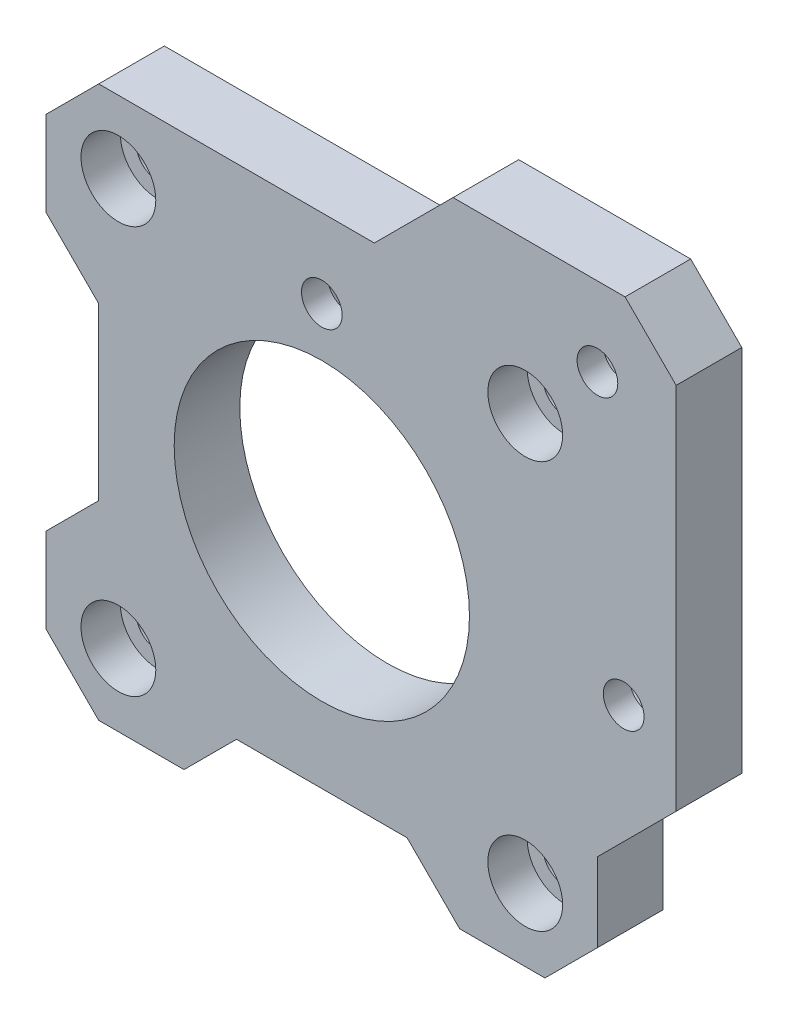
from build123d import *

# Parameters (mm, degrees)
EXTRUDE_1_DEPTH      = 5
CHAMFER_1_SIZE       = 4
SKETCH_2_R           = 11.25
CUT_EXTRUDE_1_DEPTH  = 39.509739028
SKETCH_3_R           = 1.65
CUT_EXTRUDE_2_DEPTH  = 39.509739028
SKETCH_8_R           = 1.55
CUT_EXTRUDE_6_DEPTH  = 39.509739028
SKETCH_9_R           = 1.55
CUT_EXTRUDE_7_DEPTH  = 39.509739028
SKETCH_10_R          = 1.55
CUT_EXTRUDE_8_DEPTH  = 39.509739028
SKETCH_11_R          = 2.85
CUT_EXTRUDE_9_DEPTH  = 3
CUT_EXTRUDE_10_DEPTH = 39.509739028
CUT_EXTRUDE_11_DEPTH = 3


with BuildPart() as part:
    # Sketch 1 → Extrude 1 (new body)
    with BuildSketch(Plane.XY):
        Polygon((21, -11), (27, -5), (27, 23.106645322), (23.106645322, 27), (10, 27), (4, 21), (-21, 21), (-21, -21), (21, -21), align=None)
    extrude(amount=EXTRUDE_1_DEPTH)

    # Chamfer 1
    chamfer_1_edges = [part.edges().sort_by_distance(p)[0] for p in [
        (-21, 21, 2.5),
        (21, -21, 2.5),
        (-21, -21, 2.5),
    ]]
    chamfer(chamfer_1_edges, length=CHAMFER_1_SIZE)

    # Sketch 2 → Cut-Extrude 1 (cut, through all)
    with BuildSketch(Plane.XY.offset(5)):
        Circle(SKETCH_2_R)
    extrude(amount=-CUT_EXTRUDE_1_DEPTH, mode=Mode.SUBTRACT)

    # Sketch 3 → Cut-Extrude 2 (cut, through all)
    with BuildSketch(Plane.XY.offset(5)):
        with Locations((-15.5, 15.5)):
            Circle(SKETCH_3_R)
        with Locations((15.5, 15.5)):
            Circle(SKETCH_3_R)
        with Locations((-15.5, -15.5)):
            Circle(SKETCH_3_R)
        with Locations((15.5, -15.5)):
            Circle(SKETCH_3_R)
    extrude(amount=-CUT_EXTRUDE_2_DEPTH, mode=Mode.SUBTRACT)

    # Sketch 8 → Cut-Extrude 6 (cut, through all)
    with BuildSketch(Plane.XY.offset(5)):
        with Locations((0, 15)):
            Circle(SKETCH_8_R)
    extrude(amount=-CUT_EXTRUDE_6_DEPTH, mode=Mode.SUBTRACT)

    # Sketch 9 → Cut-Extrude 7 (cut, through all)
    with BuildSketch(Plane.XY.offset(5)):
        with Locations((21, 21)):
            Circle(SKETCH_9_R)
    extrude(amount=-CUT_EXTRUDE_7_DEPTH, mode=Mode.SUBTRACT)

    # Sketch 10 → Cut-Extrude 8 (cut, through all)
    with BuildSketch(Plane.XY.offset(5)):
        with Locations((23, 0)):
            Circle(SKETCH_10_R)
    extrude(amount=-CUT_EXTRUDE_8_DEPTH, mode=Mode.SUBTRACT)

    # Sketch 11 → Cut-Extrude 9 (cut)
    with BuildSketch(Plane.XY.offset(5)):
        with Locations((-15.5, -15.5)):
            Circle(SKETCH_11_R)
        with Locations((15.5, -15.5)):
            Circle(SKETCH_11_R)
        with Locations((-15.5, 15.5)):
            Circle(SKETCH_11_R)
        with Locations((15.5, 15.5)):
            Circle(SKETCH_11_R)
    extrude(amount=-CUT_EXTRUDE_9_DEPTH, mode=Mode.SUBTRACT)

    # Sketch 12 → Cut-Extrude 10 (cut, through all)
    with BuildSketch(Plane.XY.offset(5)):
        Polygon((-10.5, -21), (-6.5, -17), (6.5, -17), (10.5, -21), align=None)
        Polygon((-21, 10.5), (-17, 6.5), (-17, -6.5), (-21, -10.5), align=None)
    extrude(amount=-CUT_EXTRUDE_10_DEPTH, mode=Mode.SUBTRACT)

    # Sketch 13 → Cut-Extrude 11 (cut)
    with BuildSketch(Plane(origin=(0, 0, 0), x_dir=(-1, 0, 0), z_dir=(0, 0, -1))):
        Polygon((-20.148253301, 17.821238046), (-17.821238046, 20.148253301), (-18.672984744, 23.327015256), (-21.851746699, 24.178761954), (-24.178761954, 21.851746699), (-23.327015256, 18.672984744), align=None)
        Polygon((-20.15, -1.645448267), (-20.15, 1.645448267), (-23, 3.290896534), (-25.85, 1.645448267), (-25.85, -1.645448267), (-23, -3.290896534), align=None)
        Polygon((-1.645448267, 12.15), (1.645448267, 12.15), (3.290896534, 15), (1.645448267, 17.85), (-1.645448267, 17.85), (-3.290896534, 15), align=None)
    extrude(amount=-CUT_EXTRUDE_11_DEPTH, mode=Mode.SUBTRACT)


solid = part.part
